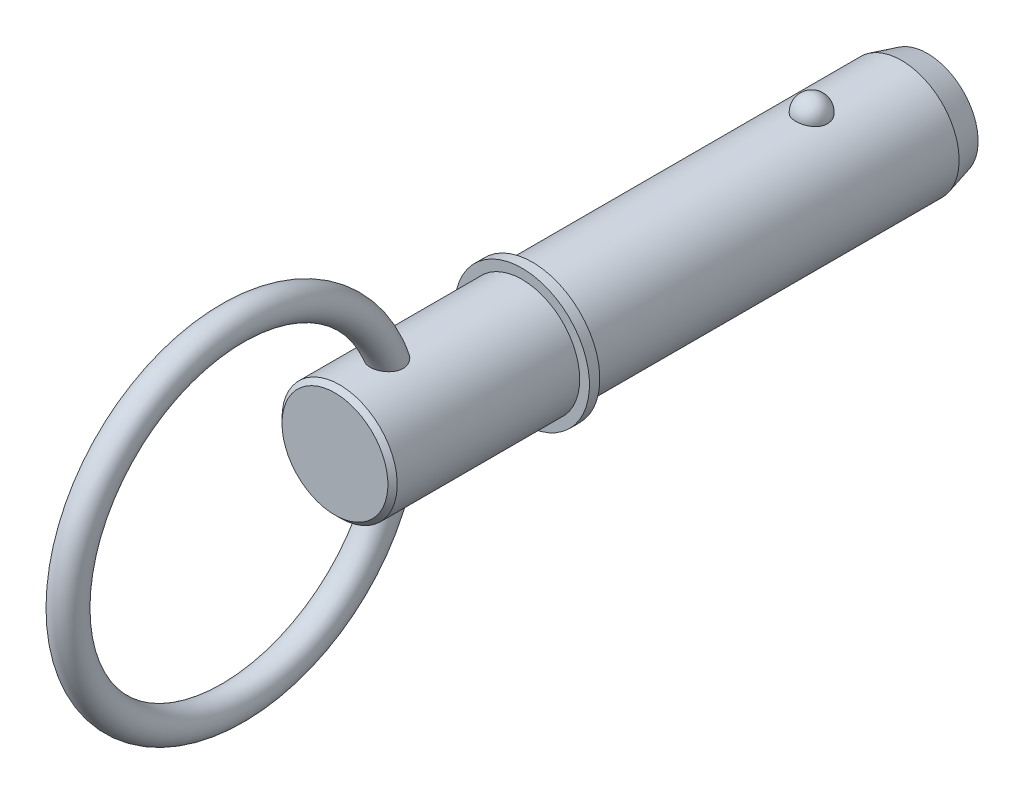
from build123d import *

# Parameters (mm, degrees)
SKETCH2_R           = 11.115
BOSS_EXTRUDE1_DEPTH = 50.8
BOSS_EXTRUDE2_START = 25.4
SKETCH3_R           = 11.115
BOSS_EXTRUDE2_DEPTH = 25.4
CHAMFER1_SIZE       = 5
CHAMFER1_SIZE2      = 1.339745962
SKETCH20_W          = 2
SKETCH20_H          = 13
SKETCH21_R          = 11.115
BOSS_EXTRUDE3_DEPTH = 38.1
CHAMFER2_SIZE       = 0.9
SKETCH24_R          = 3


with BuildPart() as part:
    # Sketch2 → Boss-Extrude1 (new body)
    with BuildSketch(Plane.XY):
        Circle(SKETCH2_R)
    extrude(amount=BOSS_EXTRUDE1_DEPTH)

    # Sketch3 → Boss-Extrude2 (add)
    with BuildSketch(Plane(origin=(0, 0, 0), x_dir=(-1, 0, 0), z_dir=(0, 0, -1)).offset(BOSS_EXTRUDE2_START)):
        Circle(SKETCH3_R)
    extrude(amount=-BOSS_EXTRUDE2_DEPTH)

    # Chamfer1
    chamfer1_edges = [part.edges().sort_by_distance(p)[0] for p in [
        (11.115, 0, -25.4),
    ]]
    chamfer1_side = [part.faces().sort_by_distance(p)[0] for p in [
        (11.115, 0, -12.7),
    ]]
    chamfer(chamfer1_edges, length=CHAMFER1_SIZE, length2=CHAMFER1_SIZE2, reference=chamfer1_side[0])

    # Sketch18 → Revolve1 (revolve)
    with BuildSketch(Plane(origin=(0, 0, 0), x_dir=(0, 0, -1), z_dir=(1, 0, 0))):
        with BuildLine():
            Line((3.07, 14.185), (3.07, 8.045))
            ThreePointArc((3.07, 8.045), (0, 11.115), (3.07, 14.185))
        make_face()
    revolve(axis=Axis((0, 14.185, -3.07), (0, -1, 0)))

    # Sketch20 → Revolve2 (revolve)
    with BuildSketch(Plane(origin=(0, 0, 0), x_dir=(0, 0, -1), z_dir=(1, 0, 0)), mode=Mode.PRIVATE) as revolve2_sk:
        with Locations((-51.8, 6.5)):
            Rectangle(SKETCH20_W, SKETCH20_H)
    revolve(revolve2_sk.sketch.rotate(Axis((0, 0, 33.728787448), (0, 0, 1)), 90), axis=Axis((0, 0, 33.728787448), (0, 0, 1)))

    # Sketch21 → Boss-Extrude3 (add)
    with BuildSketch(Plane(origin=(0, 0, 50.8), x_dir=(-1, 0, 0), z_dir=(0, 0, -1))):
        Circle(SKETCH21_R)
    extrude(amount=-BOSS_EXTRUDE3_DEPTH)

    # Chamfer2
    chamfer2_edges = [part.edges().sort_by_distance(p)[0] for p in [
        (11.115, 0, 88.9),
    ]]
    chamfer(chamfer2_edges, length=CHAMFER2_SIZE)

    # Sweep1: sweep along a path in Sketch23
    with BuildLine(Plane(origin=(0, 0, 0), x_dir=(0, 0, -1), z_dir=(1, 0, 0))) as sweep1_path:
        CenterArc((-108.65, 0), 31.75, 0, 360)
    # Sketch24 → Sweep1 (sweep)
    with BuildSketch(Plane(origin=(0, 0, 0), x_dir=(1, 0, 0), z_dir=(0, 1, 0))):
        with Locations((0, -76.9)):
            Circle(SKETCH24_R)
    sweep(path=sweep1_path.line)


solid = part.part
